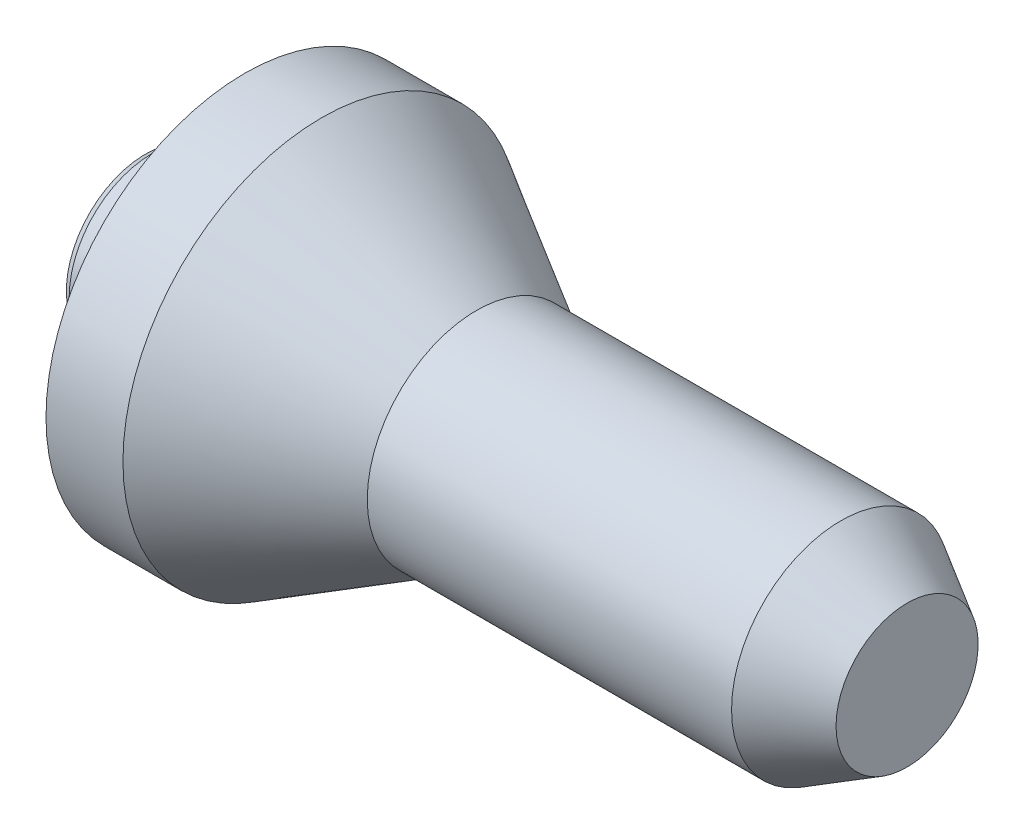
ISO-10303-21;
HEADER;
FILE_DESCRIPTION(('STEP AP214'),'2;1');
FILE_NAME('part.step','',(''),(''),'','','');
FILE_SCHEMA(('AUTOMOTIVE_DESIGN { 1 0 10303 214 1 1 1 1 }'));
ENDSEC;
DATA;
#1=APPLICATION_CONTEXT('core data for automotive mechanical design processes');
#2=APPLICATION_PROTOCOL_DEFINITION('international standard','automotive_design',2000,#1);
#3=PRODUCT_CONTEXT('',#1,'mechanical');
#4=PRODUCT('Part','Part','',(#3));
#5=PRODUCT_RELATED_PRODUCT_CATEGORY('part','',(#4));
#6=PRODUCT_DEFINITION_FORMATION('','',#4);
#7=PRODUCT_DEFINITION_CONTEXT('part definition',#1,'design');
#8=PRODUCT_DEFINITION('design','',#6,#7);
#9=PRODUCT_DEFINITION_SHAPE('','',#8);
#10=(LENGTH_UNIT() NAMED_UNIT(*) SI_UNIT(.MILLI.,.METRE.));
#11=(NAMED_UNIT(*) PLANE_ANGLE_UNIT() SI_UNIT($,.RADIAN.));
#12=(NAMED_UNIT(*) SI_UNIT($,.STERADIAN.) SOLID_ANGLE_UNIT());
#13=UNCERTAINTY_MEASURE_WITH_UNIT(LENGTH_MEASURE(1.E-05),#10,'distance_accuracy_value','');
#14=(GEOMETRIC_REPRESENTATION_CONTEXT(3) GLOBAL_UNCERTAINTY_ASSIGNED_CONTEXT((#13)) GLOBAL_UNIT_ASSIGNED_CONTEXT((#10,
#11,#12)) REPRESENTATION_CONTEXT('',''));
#15=CARTESIAN_POINT('',(0.,0.,0.));
#16=DIRECTION('',(0.,0.,1.));
#17=DIRECTION('',(1.,0.,0.));
#18=AXIS2_PLACEMENT_3D('',#15,#16,#17);
#19=CARTESIAN_POINT('',(0.,0.,0.));
#20=DIRECTION('',(1.,0.,0.));
#21=DIRECTION('',(0.,0.,-1.));
#22=AXIS2_PLACEMENT_3D('',#19,#20,#21);
#23=PLANE('',#22);
#24=CARTESIAN_POINT('',(0.,0.,0.));
#25=DIRECTION('',(1.,0.,0.));
#26=DIRECTION('',(0.,0.,-1.));
#27=AXIS2_PLACEMENT_3D('',#24,#25,#26);
#28=CIRCLE('',#27,11.9226497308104);
#29=CARTESIAN_POINT('',(0.,0.,-11.9226497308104));
#30=VERTEX_POINT('',#29);
#31=EDGE_CURVE('E41',#30,#30,#28,.F.);
#32=ORIENTED_EDGE('',*,*,#31,.T.);
#33=EDGE_LOOP('',(#32));
#34=FACE_BOUND('',#33,.T.);
#35=CARTESIAN_POINT('',(0.,0.,0.));
#36=DIRECTION('',(-1.,0.,0.));
#37=DIRECTION('',(0.,0.,1.));
#38=AXIS2_PLACEMENT_3D('',#35,#36,#37);
#39=CIRCLE('',#38,8.25);
#40=CARTESIAN_POINT('',(0.,0.,8.25));
#41=VERTEX_POINT('',#40);
#42=EDGE_CURVE('E61',#41,#41,#39,.T.);
#43=ORIENTED_EDGE('',*,*,#42,.F.);
#44=EDGE_LOOP('',(#43));
#45=FACE_BOUND('',#44,.T.);
#46=ADVANCED_FACE('F34',(#34,#45),#23,.F.);
#47=CARTESIAN_POINT('',(-16.4655274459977,0.,0.));
#48=DIRECTION('',(-1.,0.,0.));
#49=DIRECTION('',(0.,0.,1.));
#50=AXIS2_PLACEMENT_3D('',#47,#48,#49);
#51=CYLINDRICAL_SURFACE('',#50,12.5);
#52=CARTESIAN_POINT('',(1.00000000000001,0.,0.));
#53=DIRECTION('',(1.,0.,0.));
#54=DIRECTION('',(0.,0.,-1.));
#55=AXIS2_PLACEMENT_3D('',#52,#53,#54);
#56=CIRCLE('',#55,12.5);
#57=CARTESIAN_POINT('',(1.00000000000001,0.,-12.5));
#58=VERTEX_POINT('',#57);
#59=EDGE_CURVE('E11',#58,#58,#56,.T.);
#60=ORIENTED_EDGE('',*,*,#59,.T.);
#61=EDGE_LOOP('',(#60));
#62=FACE_BOUND('',#61,.T.);
#63=CARTESIAN_POINT('',(15.,0.,0.));
#64=DIRECTION('',(-1.,0.,0.));
#65=DIRECTION('',(0.,0.,1.));
#66=AXIS2_PLACEMENT_3D('',#63,#64,#65);
#67=CIRCLE('',#66,12.5);
#68=CARTESIAN_POINT('',(15.,0.,12.5));
#69=VERTEX_POINT('',#68);
#70=EDGE_CURVE('E76',#69,#69,#67,.T.);
#71=ORIENTED_EDGE('',*,*,#70,.T.);
#72=EDGE_LOOP('',(#71));
#73=FACE_BOUND('',#72,.T.);
#74=ADVANCED_FACE('F93',(#62,#73),#51,.T.);
#75=CARTESIAN_POINT('',(15.,12.5,0.));
#76=DIRECTION('',(1.,0.,0.));
#77=DIRECTION('',(0.,0.,-1.));
#78=AXIS2_PLACEMENT_3D('',#75,#76,#77);
#79=PLANE('',#78);
#80=ORIENTED_EDGE('',*,*,#70,.F.);
#81=EDGE_LOOP('',(#80));
#82=FACE_BOUND('',#81,.T.);
#83=CARTESIAN_POINT('',(15.,0.,0.));
#84=DIRECTION('',(-1.,0.,0.));
#85=DIRECTION('',(0.,0.,1.));
#86=AXIS2_PLACEMENT_3D('',#83,#84,#85);
#87=CIRCLE('',#86,30.);
#88=CARTESIAN_POINT('',(15.,0.,30.));
#89=VERTEX_POINT('',#88);
#90=EDGE_CURVE('E73',#89,#89,#87,.T.);
#91=ORIENTED_EDGE('',*,*,#90,.T.);
#92=EDGE_LOOP('',(#91));
#93=FACE_BOUND('',#92,.T.);
#94=ADVANCED_FACE('F97',(#82,#93),#79,.F.);
#95=CARTESIAN_POINT('',(-16.4655274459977,0.,0.));
#96=DIRECTION('',(-1.,0.,0.));
#97=DIRECTION('',(0.,0.,1.));
#98=AXIS2_PLACEMENT_3D('',#95,#96,#97);
#99=CYLINDRICAL_SURFACE('',#98,30.);
#100=ORIENTED_EDGE('',*,*,#90,.F.);
#101=EDGE_LOOP('',(#100));
#102=FACE_BOUND('',#101,.T.);
#103=CARTESIAN_POINT('',(26.6173140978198,0.,0.));
#104=DIRECTION('',(-1.,0.,0.));
#105=DIRECTION('',(0.,0.,1.));
#106=AXIS2_PLACEMENT_3D('',#103,#104,#105);
#107=CIRCLE('',#106,30.);
#108=CARTESIAN_POINT('',(26.6173140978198,0.,30.));
#109=VERTEX_POINT('',#108);
#110=EDGE_CURVE('E70',#109,#109,#107,.T.);
#111=ORIENTED_EDGE('',*,*,#110,.T.);
#112=EDGE_LOOP('',(#111));
#113=FACE_BOUND('',#112,.T.);
#114=ADVANCED_FACE('F103',(#102,#113),#99,.T.);
#115=CARTESIAN_POINT('',(50.,0.,0.));
#116=DIRECTION('',(-1.,0.,0.));
#117=DIRECTION('',(0.,0.,1.));
#118=AXIS2_PLACEMENT_3D('',#115,#116,#117);
#119=CONICAL_SURFACE('',#118,16.5,0.523598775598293);
#120=ORIENTED_EDGE('',*,*,#110,.F.);
#121=EDGE_LOOP('',(#120));
#122=FACE_BOUND('',#121,.T.);
#123=CARTESIAN_POINT('',(50.,0.,0.));
#124=DIRECTION('',(-1.,0.,0.));
#125=DIRECTION('',(0.,0.,1.));
#126=AXIS2_PLACEMENT_3D('',#123,#124,#125);
#127=CIRCLE('',#126,16.5);
#128=CARTESIAN_POINT('',(50.,0.,16.5));
#129=VERTEX_POINT('',#128);
#130=EDGE_CURVE('E67',#129,#129,#127,.T.);
#131=ORIENTED_EDGE('',*,*,#130,.T.);
#132=EDGE_LOOP('',(#131));
#133=FACE_BOUND('',#132,.T.);
#134=ADVANCED_FACE('F107',(#122,#133),#119,.T.);
#135=CARTESIAN_POINT('',(-16.4655274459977,0.,0.));
#136=DIRECTION('',(-1.,0.,0.));
#137=DIRECTION('',(0.,0.,1.));
#138=AXIS2_PLACEMENT_3D('',#135,#136,#137);
#139=CYLINDRICAL_SURFACE('',#138,16.5);
#140=ORIENTED_EDGE('',*,*,#130,.F.);
#141=EDGE_LOOP('',(#140));
#142=FACE_BOUND('',#141,.T.);
#143=CARTESIAN_POINT('',(105.,0.,0.));
#144=DIRECTION('',(-1.,0.,0.));
#145=DIRECTION('',(0.,0.,1.));
#146=AXIS2_PLACEMENT_3D('',#143,#144,#145);
#147=CIRCLE('',#146,16.5);
#148=CARTESIAN_POINT('',(105.,0.,16.5));
#149=VERTEX_POINT('',#148);
#150=EDGE_CURVE('E58',#149,#149,#147,.T.);
#151=ORIENTED_EDGE('',*,*,#150,.T.);
#152=EDGE_LOOP('',(#151));
#153=FACE_BOUND('',#152,.T.);
#154=ADVANCED_FACE('F111',(#142,#153),#139,.T.);
#155=CARTESIAN_POINT('',(115.,0.,0.));
#156=DIRECTION('',(-1.,0.,0.));
#157=DIRECTION('',(0.,0.,1.));
#158=AXIS2_PLACEMENT_3D('',#155,#156,#157);
#159=CONICAL_SURFACE('',#158,10.7264973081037,0.5235987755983);
#160=ORIENTED_EDGE('',*,*,#150,.F.);
#161=EDGE_LOOP('',(#160));
#162=FACE_BOUND('',#161,.T.);
#163=CARTESIAN_POINT('',(115.,0.,0.));
#164=DIRECTION('',(-1.,0.,0.));
#165=DIRECTION('',(0.,0.,1.));
#166=AXIS2_PLACEMENT_3D('',#163,#164,#165);
#167=CIRCLE('',#166,10.7264973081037);
#168=CARTESIAN_POINT('',(115.,0.,10.7264973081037));
#169=VERTEX_POINT('',#168);
#170=EDGE_CURVE('E54',#169,#169,#167,.T.);
#171=ORIENTED_EDGE('',*,*,#170,.T.);
#172=EDGE_LOOP('',(#171));
#173=FACE_BOUND('',#172,.T.);
#174=ADVANCED_FACE('F115',(#162,#173),#159,.T.);
#175=CARTESIAN_POINT('',(115.,10.7264973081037,0.));
#176=DIRECTION('',(-1.,0.,0.));
#177=DIRECTION('',(0.,0.,1.));
#178=AXIS2_PLACEMENT_3D('',#175,#176,#177);
#179=PLANE('',#178);
#180=ORIENTED_EDGE('',*,*,#170,.F.);
#181=EDGE_LOOP('',(#180));
#182=FACE_BOUND('',#181,.T.);
#183=ADVANCED_FACE('F48',(#182),#179,.F.);
#184=CARTESIAN_POINT('',(45.,0.,0.));
#185=DIRECTION('',(-1.,0.,0.));
#186=DIRECTION('',(0.,0.,1.));
#187=AXIS2_PLACEMENT_3D('',#184,#185,#186);
#188=CONICAL_SURFACE('',#187,6.99999999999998,1.02974425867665);
#189=CARTESIAN_POINT('',(49.2060243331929,0.,0.));
#190=VERTEX_POINT('',#189);
#191=VERTEX_LOOP('',#190);
#192=FACE_BOUND('',#191,.T.);
#193=CARTESIAN_POINT('',(45.,0.,0.));
#194=DIRECTION('',(-1.,0.,0.));
#195=DIRECTION('',(0.,0.,1.));
#196=AXIS2_PLACEMENT_3D('',#193,#194,#195);
#197=CIRCLE('',#196,6.99999999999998);
#198=CARTESIAN_POINT('',(45.,0.,6.99999999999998));
#199=VERTEX_POINT('',#198);
#200=EDGE_CURVE('E52',#199,#199,#197,.T.);
#201=ORIENTED_EDGE('',*,*,#200,.T.);
#202=EDGE_LOOP('',(#201));
#203=FACE_BOUND('',#202,.T.);
#204=ADVANCED_FACE('F44',(#192,#203),#188,.F.);
#205=CARTESIAN_POINT('',(0.,0.,0.));
#206=DIRECTION('',(-1.,0.,0.));
#207=DIRECTION('',(0.,0.,1.));
#208=AXIS2_PLACEMENT_3D('',#205,#206,#207);
#209=CYLINDRICAL_SURFACE('',#208,6.99999999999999);
#210=ORIENTED_EDGE('',*,*,#200,.F.);
#211=EDGE_LOOP('',(#210));
#212=FACE_BOUND('',#211,.T.);
#213=CARTESIAN_POINT('',(1.25,0.,0.));
#214=DIRECTION('',(-1.,0.,0.));
#215=DIRECTION('',(0.,0.,1.));
#216=AXIS2_PLACEMENT_3D('',#213,#214,#215);
#217=CIRCLE('',#216,6.99999999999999);
#218=CARTESIAN_POINT('',(1.25,0.,6.99999999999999));
#219=VERTEX_POINT('',#218);
#220=EDGE_CURVE('E55',#219,#219,#217,.T.);
#221=ORIENTED_EDGE('',*,*,#220,.T.);
#222=EDGE_LOOP('',(#221));
#223=FACE_BOUND('',#222,.T.);
#224=ADVANCED_FACE('F47',(#212,#223),#209,.F.);
#225=CARTESIAN_POINT('',(0.,0.,0.));
#226=DIRECTION('',(-1.,0.,0.));
#227=DIRECTION('',(0.,0.,1.));
#228=AXIS2_PLACEMENT_3D('',#225,#226,#227);
#229=CONICAL_SURFACE('',#228,8.25,0.78539816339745);
#230=ORIENTED_EDGE('',*,*,#220,.F.);
#231=EDGE_LOOP('',(#230));
#232=FACE_BOUND('',#231,.T.);
#233=ORIENTED_EDGE('',*,*,#42,.T.);
#234=EDGE_LOOP('',(#233));
#235=FACE_BOUND('',#234,.T.);
#236=ADVANCED_FACE('F84',(#232,#235),#229,.F.);
#237=CARTESIAN_POINT('',(0.,0.,0.));
#238=DIRECTION('',(1.,0.,0.));
#239=DIRECTION('',(0.,0.,-1.));
#240=AXIS2_PLACEMENT_3D('',#237,#238,#239);
#241=CONICAL_SURFACE('',#240,11.9226497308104,0.52359877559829);
#242=ORIENTED_EDGE('',*,*,#59,.F.);
#243=EDGE_LOOP('',(#242));
#244=FACE_BOUND('',#243,.T.);
#245=ORIENTED_EDGE('',*,*,#31,.F.);
#246=EDGE_LOOP('',(#245));
#247=FACE_BOUND('',#246,.T.);
#248=ADVANCED_FACE('F36',(#244,#247),#241,.T.);
#249=CLOSED_SHELL('',(#46,#74,#94,#114,#134,#154,#174,#183,#204,#224,#236,#248));
#250=MANIFOLD_SOLID_BREP('B2',#249);
#251=ADVANCED_BREP_SHAPE_REPRESENTATION('',(#18,#250),#14);
#252=SHAPE_DEFINITION_REPRESENTATION(#9,#251);
ENDSEC;
END-ISO-10303-21;
